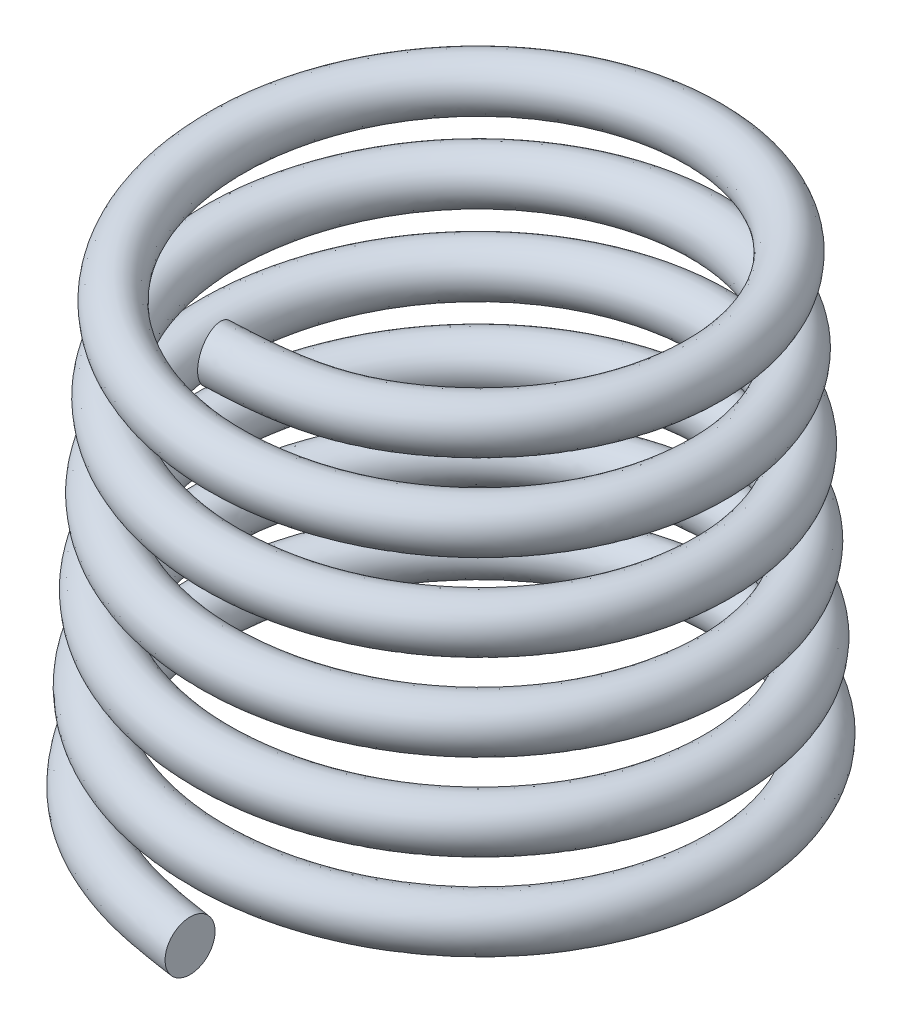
from build123d import *

# Parameters (mm, degrees)
ESQUISSE3_R = 0.5000000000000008


with BuildPart() as part:
    # Base-Balayage: sweep along a curve in space
    with BuildLine() as base_balayage_path:
        add(Edge.make_bspline(
            [(0, 0, 5.25), (-0.6865733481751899, 0.03471460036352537, 5.169356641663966), (-2.059007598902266, 0.10410777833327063, 5.008153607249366), (-3.800755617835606, 0.20828049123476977, 3.791518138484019), (-4.9609877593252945, 0.31244546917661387, 2.057914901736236), (-5.364274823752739, 0.41661251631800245, -0.00033606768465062), (-4.95091012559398, 0.5207790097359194, -2.050153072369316), (-3.785452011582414, 0.624945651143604, -3.7849879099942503), (-2.0467252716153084, 0.7291122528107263, -4.940268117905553), (-0.00036365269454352, 0.8332788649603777, -5.341875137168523), (2.041766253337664, 0.9374454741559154, -4.9302091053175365), (3.7690950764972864, 1.0416120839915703, -3.7696096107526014), (4.919581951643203, 1.1457786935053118, -2.0381511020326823), (5.319466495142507, 1.2499453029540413, -0.00036365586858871), (4.909510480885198, 1.3541119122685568, 2.0331922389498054), (3.7537665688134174, 1.4582785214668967, 3.753252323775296), (2.029577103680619, 1.5624451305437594, 4.898882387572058), (0.00036361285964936, 1.666611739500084, 5.297061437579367), (-2.0246182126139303, 1.770778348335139, 4.888810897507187), (-3.737409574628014, 1.8749449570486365, 3.7379237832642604), (-4.8781828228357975, 1.979111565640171, 2.021003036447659), (-5.274656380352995, 2.0832781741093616, 0.00036358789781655), (-4.8681113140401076, 2.1874447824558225, -2.016044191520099), (-3.7220809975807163, 2.291611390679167, -3.721566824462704), (-2.0124289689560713, 2.3957779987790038, -4.85748325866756), (-0.00036356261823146, 2.4999446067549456, -5.252251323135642), (2.007470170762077, 2.6041112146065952, -4.847411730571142), (3.7057240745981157, 2.7082778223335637, -3.7062382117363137), (4.836783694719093, 2.81244442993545, -2.0038549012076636), (5.229846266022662, 2.9166110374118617, -0.00036353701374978), (4.826712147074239, 3.020777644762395, 1.9988961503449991), (3.6903954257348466, 3.1249442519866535, 3.689881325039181), (1.9952808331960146, 3.2291108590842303, 4.816084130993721), (0.00036351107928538, 3.3332774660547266, 5.2074412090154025), (-1.990322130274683, 3.437444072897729, 4.8060125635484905), (-3.6740385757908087, 3.541610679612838, 3.674552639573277), (-4.795384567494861, 3.6457772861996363, 1.986706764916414), (-5.185036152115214, 3.7499438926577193, 0.00036348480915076), (-4.7853129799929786, 3.854110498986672, -1.9817481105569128), (-3.6587098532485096, 3.9582771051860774, -3.658195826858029), (-1.978132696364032, 4.062443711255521, -4.7746850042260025), (-0.00036345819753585, 4.166610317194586, -5.162631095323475), (1.9731740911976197, 4.270776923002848, -4.764613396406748), (3.6423530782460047, 4.37494352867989, -3.642867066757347), (4.753985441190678, 4.479110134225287, -1.969558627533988), (5.140226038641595, 4.583276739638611, -0.00036343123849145), (4.743913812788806, 4.687443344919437, 1.964600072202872), (3.6270242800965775, 4.791609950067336, 3.626510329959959), (1.9609845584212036, 4.895776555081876, 4.733285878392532), (0.00036340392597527, 4.999943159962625, 5.117820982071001), (-1.9560260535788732, 5.104109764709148, 4.723214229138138), (-3.6106675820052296, 5.208276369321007, 3.6111814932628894), (-4.712586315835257, 5.3124429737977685, 1.9524104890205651), (-5.095415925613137, 5.416609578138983, 0.00036337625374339), (-4.702514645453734, 5.52077618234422, -1.9474520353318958), (-3.595338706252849, 5.6249427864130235, -3.5948248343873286), (-1.9438364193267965, 5.729109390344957, -4.691886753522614), (-0.00036334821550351, 5.833275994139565, -5.073010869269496), (1.938878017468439, 5.937442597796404, -4.681815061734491), (3.5789820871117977, 6.041609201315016, -3.579495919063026), (4.67118719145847, 6.145775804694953, -1.9352623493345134), (5.050605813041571, 6.249942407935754, -0.0003633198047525), (4.661115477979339, 6.354109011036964, 1.9303039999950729), (3.56365313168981, 6.458275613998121, 3.5631393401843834), (1.9266882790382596, 6.562442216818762, 4.650487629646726), (0.0003632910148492, 6.666608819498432, 5.0282007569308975), (-1.9217299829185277, 6.77077542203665, 4.640415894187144), (-3.547296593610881, 6.874942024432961, 3.5478103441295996), (-4.629788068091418, 6.979108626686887, 1.9181142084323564), (-5.0057957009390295, 7.0832752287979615, 0.00036326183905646), (-4.619716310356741, 7.187441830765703, -1.9131559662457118), (-3.5319675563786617, 7.291608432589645, -3.5314538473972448), (-1.9095401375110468, 7.395775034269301, -4.609088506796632), (-0.0003632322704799, 7.499941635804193, -4.983390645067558), (1.9045819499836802, 7.604108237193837, -4.599016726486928), (3.515611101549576, 7.708274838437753, -3.5161247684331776), (4.588388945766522, 7.8124414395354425, -1.9009660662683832), (4.960985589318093, 7.916608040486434, -0.00036320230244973), (4.578317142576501, 8.020774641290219, 1.8960079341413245), (3.5002819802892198, 8.124941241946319, 3.4997683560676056), (1.8923919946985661, 8.229107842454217, 4.5676893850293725), (0.00036317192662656, 8.333274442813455, 4.938580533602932), (-1.8874339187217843, 8.437441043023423, 4.557617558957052), (-3.4839256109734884, 8.541607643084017, 3.484439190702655), (-4.546989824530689, 8.645774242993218, 1.8838179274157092), (-4.916175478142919, 8.749940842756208, 0.00036312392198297), (-4.5369179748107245, 8.854107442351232, -1.8788598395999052), (-3.468596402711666, 8.958274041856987, -3.4680831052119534), (-1.8752438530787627, 9.062440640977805, -4.526289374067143), (-0.00036310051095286, 9.166607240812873, -4.893773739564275), (1.870285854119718, 9.270773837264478, -4.516206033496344), (3.452240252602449, 9.374940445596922, -3.452799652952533), (4.505590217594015, 9.479107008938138, -1.8664982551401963), (4.871367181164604, 9.583273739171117, -0.00100211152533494), (4.49551204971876, 9.687439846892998, 1.8640926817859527), (3.4369359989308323, 9.791608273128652, 3.4275273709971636), (1.8580019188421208, 9.895768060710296, 4.517937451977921), (0.6190964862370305, 9.96526934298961, 4.656620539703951), (-3.9063e-13, 10.000000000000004, 4.725922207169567)],
            knots=[0, 0, 0, 0, 0.01095667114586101, 0.02190197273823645, 0.03283590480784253, 0.04375846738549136, 0.05466966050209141, 0.06556948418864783, 0.07645793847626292, 0.08733502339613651, 0.09820073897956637, 0.10905508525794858, 0.11989806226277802, 0.13072967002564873, 0.14154990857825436, 0.15235877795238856, 0.16315627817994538, 0.1739424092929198, 0.18471717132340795, 0.19548056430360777, 0.20623258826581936, 0.21697324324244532, 0.22770252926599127, 0.23842044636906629, 0.24912699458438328, 0.2598221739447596, 0.2705059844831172, 0.2811784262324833, 0.2918394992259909, 0.30248920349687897, 0.31312753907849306, 0.32375450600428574, 0.3343701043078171, 0.3449743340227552, 0.3555671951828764, 0.36614868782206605, 0.37671881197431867, 0.38727756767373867, 0.3978249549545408, 0.4083609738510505, 0.4188856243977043, 0.42939890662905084, 0.43990082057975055, 0.4503913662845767, 0.46087054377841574, 0.47133835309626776, 0.48179479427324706, 0.49223986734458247, 0.5026735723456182, 0.5130959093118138, 0.5235068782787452, 0.533906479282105, 0.5442947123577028, 0.554671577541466, 0.5650370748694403, 0.57539120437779, 0.5857339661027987, 0.5960653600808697, 0.6063853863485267, 0.6166940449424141, 0.6269913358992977, 0.6372772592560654, 0.6475518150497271, 0.6578150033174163, 0.6680668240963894, 0.6783072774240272, 0.6885363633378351, 0.6987540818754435, 0.7089604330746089, 0.7191554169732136, 0.7293390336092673, 0.7395112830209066, 0.7496721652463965, 0.7598216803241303, 0.7699598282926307, 0.7800866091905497, 0.7902020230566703, 0.8003060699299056, 0.8103987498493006, 0.8204800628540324, 0.8305500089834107, 0.8406085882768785, 0.8506558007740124, 0.860691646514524, 0.8707161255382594, 0.880729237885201, 0.890730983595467, 0.9007213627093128, 0.9107003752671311, 0.9206680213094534, 0.9306243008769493, 0.940569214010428, 0.9505027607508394, 0.9604249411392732, 0.9703357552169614, 0.9802352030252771, 0.9901232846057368, 1, 1, 1, 1], degree=3))
    # Esquisse3 → Base-Balayage (sweep)
    with BuildSketch(Plane(origin=(0, 0, 0), x_dir=(0, 0, -1), z_dir=(1, 0, 0))):
        with Locations((-5.249999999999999, 0)):
            Circle(ESQUISSE3_R)
    sweep(path=base_balayage_path.line, is_frenet=True)


solid = part.part
